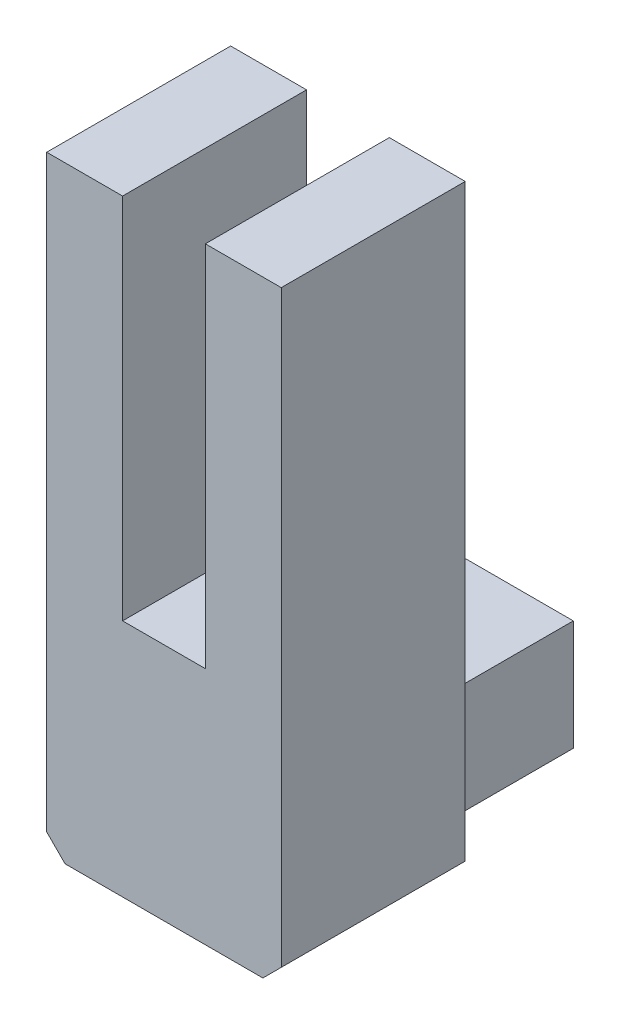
from build123d import *

# Parameters (mm, degrees)
EXTRUSION1_DEPTH = 20
ESQUISSE2_W      = 12
ESQUISSE2_H      = 12
EXTRUSION2_DEPTH = 18.5


with BuildPart() as part:
    # Esquisse1 → Extrusion1 (new body)
    with BuildSketch(Plane.XY):
        Polygon((4.5, 0), (-4.5, 0), (-4.5, 40), (-12.75, 40), (-12.75, -24), (-10.75, -26), (10.75, -26), (12.75, -24), (12.75, 40), (4.5, 40), align=None)
    extrude(amount=EXTRUSION1_DEPTH)

    # Esquisse2 → Extrusion2 (add)
    with BuildSketch(Plane(origin=(0, 0, 0), x_dir=(-1, 0, 0), z_dir=(0, 0, -1))):
        with Locations((0, -20)):
            Rectangle(ESQUISSE2_W, ESQUISSE2_H)
    extrude(amount=EXTRUSION2_DEPTH)


solid = part.part
